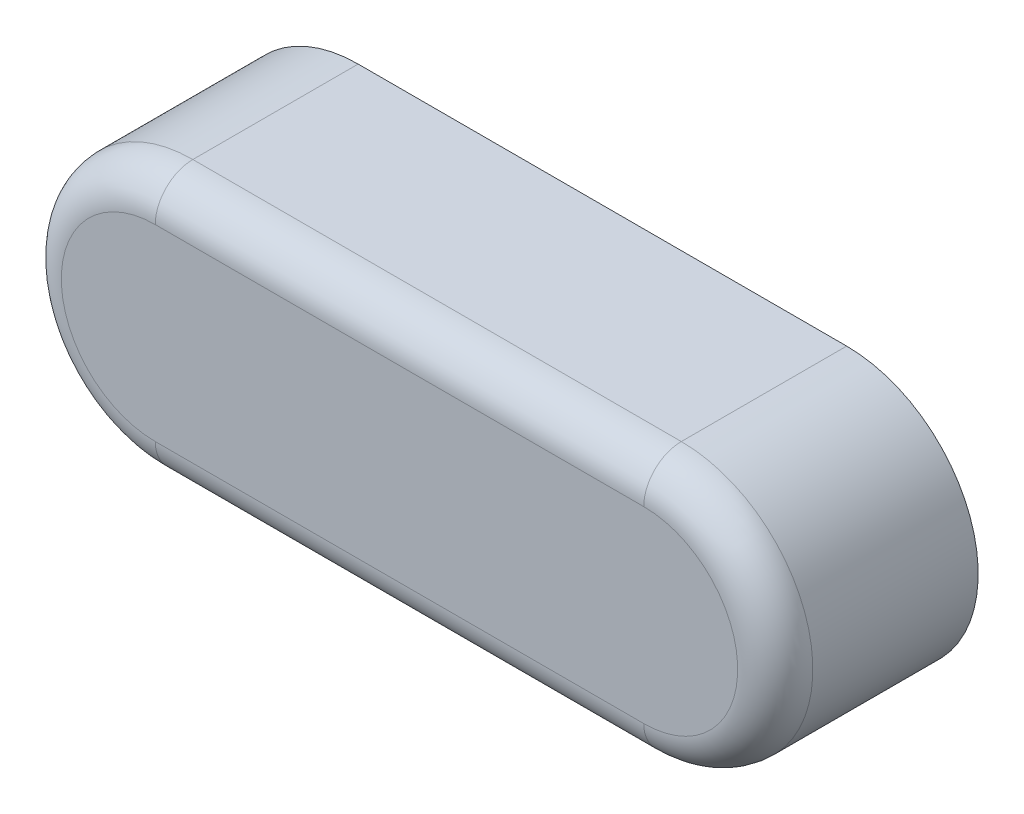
from build123d import *

# Parameters (mm, degrees)
BOSS_EXTRUDE1_DEPTH = 2.7
FILLET1_R           = 0.5


with BuildPart() as part:
    # Sketch1 → Boss-Extrude1 (new body)
    with BuildSketch(Plane.XY):
        with BuildLine():
            Line((-3.25, 1.75), (3.25, 1.75))
            ThreePointArc((3.25, 1.75), (5, 0), (3.25, -1.75))
            Line((3.25, -1.75), (-3.25, -1.75))
            ThreePointArc((-3.25, -1.75), (-5, 0), (-3.25, 1.75))
        make_face()
    extrude(amount=BOSS_EXTRUDE1_DEPTH)

    # Fillet1
    fillet1_edges = [part.edges().sort_by_distance(p)[0] for p in [
        (5, 0, 2.7),
        (0, 1.75, 2.7),
        (-5, 0, 2.7),
        (0, -1.75, 2.7),
    ]]
    fillet(fillet1_edges, radius=FILLET1_R)


solid = part.part
